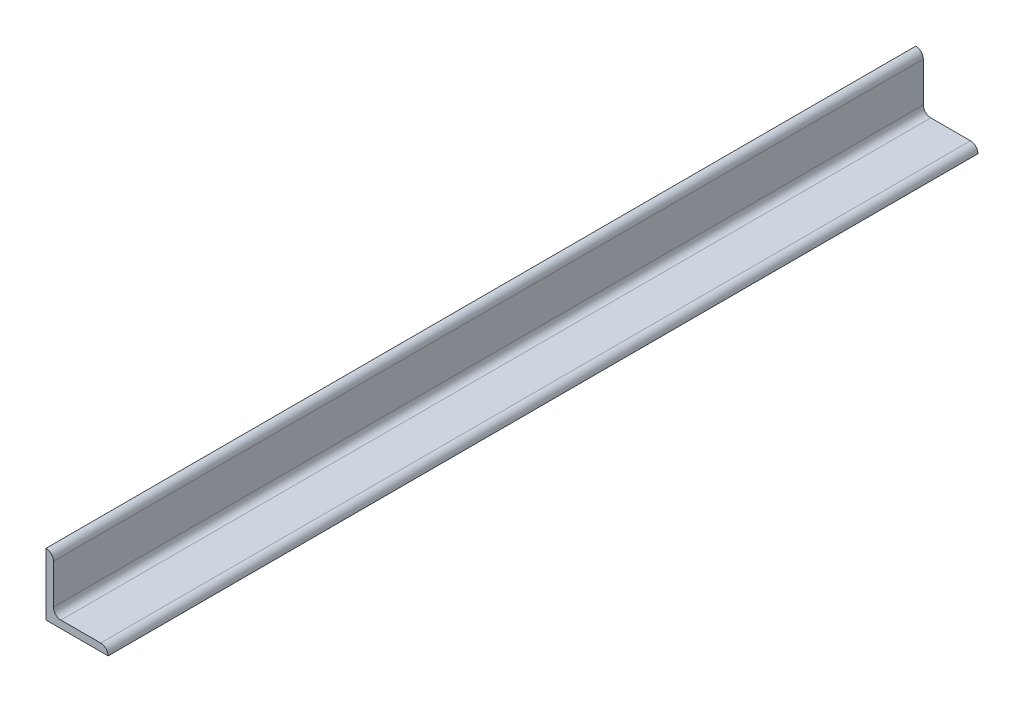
ISO-10303-21;
HEADER;
FILE_DESCRIPTION(('STEP AP214'),'2;1');
FILE_NAME('part.step','',(''),(''),'','','');
FILE_SCHEMA(('AUTOMOTIVE_DESIGN { 1 0 10303 214 1 1 1 1 }'));
ENDSEC;
DATA;
#1=APPLICATION_CONTEXT('core data for automotive mechanical design processes');
#2=APPLICATION_PROTOCOL_DEFINITION('international standard','automotive_design',2000,#1);
#3=PRODUCT_CONTEXT('',#1,'mechanical');
#4=PRODUCT('Part','Part','',(#3));
#5=PRODUCT_RELATED_PRODUCT_CATEGORY('part','',(#4));
#6=PRODUCT_DEFINITION_FORMATION('','',#4);
#7=PRODUCT_DEFINITION_CONTEXT('part definition',#1,'design');
#8=PRODUCT_DEFINITION('design','',#6,#7);
#9=PRODUCT_DEFINITION_SHAPE('','',#8);
#10=(LENGTH_UNIT() NAMED_UNIT(*) SI_UNIT(.MILLI.,.METRE.));
#11=(NAMED_UNIT(*) PLANE_ANGLE_UNIT() SI_UNIT($,.RADIAN.));
#12=(NAMED_UNIT(*) SI_UNIT($,.STERADIAN.) SOLID_ANGLE_UNIT());
#13=UNCERTAINTY_MEASURE_WITH_UNIT(LENGTH_MEASURE(1.E-05),#10,'distance_accuracy_value','');
#14=(GEOMETRIC_REPRESENTATION_CONTEXT(3) GLOBAL_UNCERTAINTY_ASSIGNED_CONTEXT((#13)) GLOBAL_UNIT_ASSIGNED_CONTEXT((#10,
#11,#12)) REPRESENTATION_CONTEXT('',''));
#15=CARTESIAN_POINT('',(0.,0.,0.));
#16=DIRECTION('',(0.,0.,1.));
#17=DIRECTION('',(1.,0.,0.));
#18=AXIS2_PLACEMENT_3D('',#15,#16,#17);
#19=CARTESIAN_POINT('',(50.,0.,-350.));
#20=DIRECTION('',(0.,-1.,0.));
#21=DIRECTION('',(1.,0.,0.));
#22=AXIS2_PLACEMENT_3D('',#19,#20,#21);
#23=PLANE('',#22);
#24=DIRECTION('',(1.,0.,0.));
#25=VECTOR('',#24,1.);
#26=CARTESIAN_POINT('',(50.,0.,350.));
#27=LINE('',#26,#25);
#28=CARTESIAN_POINT('',(0.,0.,350.));
#29=VERTEX_POINT('',#28);
#30=CARTESIAN_POINT('',(50.,0.,350.));
#31=VERTEX_POINT('',#30);
#32=EDGE_CURVE('E130',#29,#31,#27,.T.);
#33=ORIENTED_EDGE('',*,*,#32,.F.);
#34=DIRECTION('',(0.,0.,1.));
#35=VECTOR('',#34,1.);
#36=CARTESIAN_POINT('',(0.,0.,-350.));
#37=LINE('',#36,#35);
#38=CARTESIAN_POINT('',(0.,0.,-350.));
#39=VERTEX_POINT('',#38);
#40=EDGE_CURVE('E106',#39,#29,#37,.T.);
#41=ORIENTED_EDGE('',*,*,#40,.F.);
#42=DIRECTION('',(1.,0.,0.));
#43=VECTOR('',#42,1.);
#44=CARTESIAN_POINT('',(50.,0.,-350.));
#45=LINE('',#44,#43);
#46=CARTESIAN_POINT('',(50.,0.,-350.));
#47=VERTEX_POINT('',#46);
#48=EDGE_CURVE('E95',#39,#47,#45,.T.);
#49=ORIENTED_EDGE('',*,*,#48,.T.);
#50=DIRECTION('',(0.,0.,1.));
#51=VECTOR('',#50,1.);
#52=CARTESIAN_POINT('',(50.,0.,-350.));
#53=LINE('',#52,#51);
#54=EDGE_CURVE('E104',#47,#31,#53,.T.);
#55=ORIENTED_EDGE('',*,*,#54,.T.);
#56=EDGE_LOOP('',(#33,#41,#49,#55));
#57=FACE_BOUND('',#56,.T.);
#58=ADVANCED_FACE('F32',(#57),#23,.T.);
#59=CARTESIAN_POINT('',(0.,50.,-350.));
#60=DIRECTION('',(-1.,0.,0.));
#61=DIRECTION('',(0.,-1.,0.));
#62=AXIS2_PLACEMENT_3D('',#59,#60,#61);
#63=PLANE('',#62);
#64=DIRECTION('',(0.,-1.,0.));
#65=VECTOR('',#64,1.);
#66=CARTESIAN_POINT('',(0.,50.,350.));
#67=LINE('',#66,#65);
#68=CARTESIAN_POINT('',(0.,50.,350.));
#69=VERTEX_POINT('',#68);
#70=EDGE_CURVE('E107',#69,#29,#67,.T.);
#71=ORIENTED_EDGE('',*,*,#70,.F.);
#72=DIRECTION('',(0.,0.,1.));
#73=VECTOR('',#72,1.);
#74=CARTESIAN_POINT('',(0.,50.,-350.));
#75=LINE('',#74,#73);
#76=CARTESIAN_POINT('',(0.,50.,-350.));
#77=VERTEX_POINT('',#76);
#78=EDGE_CURVE('E144',#77,#69,#75,.T.);
#79=ORIENTED_EDGE('',*,*,#78,.F.);
#80=DIRECTION('',(0.,-1.,0.));
#81=VECTOR('',#80,1.);
#82=CARTESIAN_POINT('',(0.,50.,-350.));
#83=LINE('',#82,#81);
#84=EDGE_CURVE('E112',#77,#39,#83,.T.);
#85=ORIENTED_EDGE('',*,*,#84,.T.);
#86=ORIENTED_EDGE('',*,*,#40,.T.);
#87=EDGE_LOOP('',(#71,#79,#85,#86));
#88=FACE_BOUND('',#87,.T.);
#89=ADVANCED_FACE('F157',(#88),#63,.T.);
#90=CARTESIAN_POINT('',(6.,50.,-350.));
#91=DIRECTION('',(1.,0.,0.));
#92=DIRECTION('',(0.,1.,0.));
#93=AXIS2_PLACEMENT_3D('',#90,#91,#92);
#94=PLANE('',#93);
#95=DIRECTION('',(0.,1.,0.));
#96=VECTOR('',#95,1.);
#97=CARTESIAN_POINT('',(6.,50.,-350.));
#98=LINE('',#97,#96);
#99=CARTESIAN_POINT('',(6.,12.,-350.));
#100=VERTEX_POINT('',#99);
#101=CARTESIAN_POINT('',(6.,44.,-350.));
#102=VERTEX_POINT('',#101);
#103=EDGE_CURVE('E117',#100,#102,#98,.T.);
#104=ORIENTED_EDGE('',*,*,#103,.T.);
#105=DIRECTION('',(0.,0.,1.));
#106=VECTOR('',#105,1.);
#107=CARTESIAN_POINT('',(6.,44.,-350.));
#108=LINE('',#107,#106);
#109=CARTESIAN_POINT('',(6.,44.,350.));
#110=VERTEX_POINT('',#109);
#111=EDGE_CURVE('E11',#102,#110,#108,.T.);
#112=ORIENTED_EDGE('',*,*,#111,.T.);
#113=DIRECTION('',(0.,1.,0.));
#114=VECTOR('',#113,1.);
#115=CARTESIAN_POINT('',(6.,50.,350.));
#116=LINE('',#115,#114);
#117=CARTESIAN_POINT('',(6.,12.,350.));
#118=VERTEX_POINT('',#117);
#119=EDGE_CURVE('E136',#118,#110,#116,.T.);
#120=ORIENTED_EDGE('',*,*,#119,.F.);
#121=DIRECTION('',(0.,0.,1.));
#122=VECTOR('',#121,1.);
#123=CARTESIAN_POINT('',(6.,12.,-350.));
#124=LINE('',#123,#122);
#125=EDGE_CURVE('E115',#100,#118,#124,.T.);
#126=ORIENTED_EDGE('',*,*,#125,.F.);
#127=EDGE_LOOP('',(#104,#112,#120,#126));
#128=FACE_BOUND('',#127,.T.);
#129=ADVANCED_FACE('F152',(#128),#94,.T.);
#130=CARTESIAN_POINT('',(12.,12.,-350.));
#131=DIRECTION('',(0.,0.,1.));
#132=DIRECTION('',(1.,0.,0.));
#133=AXIS2_PLACEMENT_3D('',#130,#131,#132);
#134=CYLINDRICAL_SURFACE('',#133,6.);
#135=CARTESIAN_POINT('',(12.,12.,350.));
#136=DIRECTION('',(0.,0.,-1.));
#137=DIRECTION('',(-1.,0.,0.));
#138=AXIS2_PLACEMENT_3D('',#135,#136,#137);
#139=CIRCLE('',#138,6.);
#140=CARTESIAN_POINT('',(12.,6.,350.));
#141=VERTEX_POINT('',#140);
#142=EDGE_CURVE('E134',#141,#118,#139,.T.);
#143=ORIENTED_EDGE('',*,*,#142,.F.);
#144=DIRECTION('',(0.,0.,1.));
#145=VECTOR('',#144,1.);
#146=CARTESIAN_POINT('',(12.,6.,-350.));
#147=LINE('',#146,#145);
#148=CARTESIAN_POINT('',(12.,6.,-350.));
#149=VERTEX_POINT('',#148);
#150=EDGE_CURVE('E111',#149,#141,#147,.T.);
#151=ORIENTED_EDGE('',*,*,#150,.F.);
#152=CARTESIAN_POINT('',(12.,12.,-350.));
#153=DIRECTION('',(0.,0.,-1.));
#154=DIRECTION('',(-1.,0.,0.));
#155=AXIS2_PLACEMENT_3D('',#152,#153,#154);
#156=CIRCLE('',#155,6.);
#157=EDGE_CURVE('E150',#149,#100,#156,.T.);
#158=ORIENTED_EDGE('',*,*,#157,.T.);
#159=ORIENTED_EDGE('',*,*,#125,.T.);
#160=EDGE_LOOP('',(#143,#151,#158,#159));
#161=FACE_BOUND('',#160,.T.);
#162=ADVANCED_FACE('F149',(#161),#134,.F.);
#163=CARTESIAN_POINT('',(12.,6.,-350.));
#164=DIRECTION('',(0.,1.,0.));
#165=DIRECTION('',(0.,0.,1.));
#166=AXIS2_PLACEMENT_3D('',#163,#164,#165);
#167=PLANE('',#166);
#168=DIRECTION('',(-1.,0.,0.));
#169=VECTOR('',#168,1.);
#170=CARTESIAN_POINT('',(12.,6.,350.));
#171=LINE('',#170,#169);
#172=CARTESIAN_POINT('',(44.,6.,350.));
#173=VERTEX_POINT('',#172);
#174=EDGE_CURVE('E128',#173,#141,#171,.T.);
#175=ORIENTED_EDGE('',*,*,#174,.F.);
#176=DIRECTION('',(0.,0.,1.));
#177=VECTOR('',#176,1.);
#178=CARTESIAN_POINT('',(44.,6.,-350.));
#179=LINE('',#178,#177);
#180=CARTESIAN_POINT('',(44.,6.,-350.));
#181=VERTEX_POINT('',#180);
#182=EDGE_CURVE('E55',#173,#181,#179,.F.);
#183=ORIENTED_EDGE('',*,*,#182,.T.);
#184=DIRECTION('',(-1.,0.,0.));
#185=VECTOR('',#184,1.);
#186=CARTESIAN_POINT('',(12.,6.,-350.));
#187=LINE('',#186,#185);
#188=EDGE_CURVE('E98',#181,#149,#187,.T.);
#189=ORIENTED_EDGE('',*,*,#188,.T.);
#190=ORIENTED_EDGE('',*,*,#150,.T.);
#191=EDGE_LOOP('',(#175,#183,#189,#190));
#192=FACE_BOUND('',#191,.T.);
#193=ADVANCED_FACE('F131',(#192),#167,.T.);
#194=CARTESIAN_POINT('',(12.,12.,-350.));
#195=DIRECTION('',(0.,0.,-1.));
#196=DIRECTION('',(-1.,0.,0.));
#197=AXIS2_PLACEMENT_3D('',#194,#195,#196);
#198=PLANE('',#197);
#199=ORIENTED_EDGE('',*,*,#188,.F.);
#200=CARTESIAN_POINT('',(44.,0.,-350.));
#201=DIRECTION('',(0.,0.,-1.));
#202=DIRECTION('',(-1.,0.,0.));
#203=AXIS2_PLACEMENT_3D('',#200,#201,#202);
#204=CIRCLE('',#203,6.);
#205=EDGE_CURVE('E40',#181,#47,#204,.T.);
#206=ORIENTED_EDGE('',*,*,#205,.T.);
#207=ORIENTED_EDGE('',*,*,#48,.F.);
#208=ORIENTED_EDGE('',*,*,#84,.F.);
#209=CARTESIAN_POINT('',(0.,44.,-350.));
#210=DIRECTION('',(0.,0.,-1.));
#211=DIRECTION('',(-1.,0.,0.));
#212=AXIS2_PLACEMENT_3D('',#209,#210,#211);
#213=CIRCLE('',#212,6.);
#214=EDGE_CURVE('E47',#77,#102,#213,.T.);
#215=ORIENTED_EDGE('',*,*,#214,.T.);
#216=ORIENTED_EDGE('',*,*,#103,.F.);
#217=ORIENTED_EDGE('',*,*,#157,.F.);
#218=EDGE_LOOP('',(#199,#206,#207,#208,#215,#216,#217));
#219=FACE_BOUND('',#218,.T.);
#220=ADVANCED_FACE('F94',(#219),#198,.T.);
#221=CARTESIAN_POINT('',(12.,12.,350.));
#222=DIRECTION('',(0.,0.,-1.));
#223=DIRECTION('',(-1.,0.,0.));
#224=AXIS2_PLACEMENT_3D('',#221,#222,#223);
#225=PLANE('',#224);
#226=ORIENTED_EDGE('',*,*,#32,.T.);
#227=CARTESIAN_POINT('',(44.,0.,350.));
#228=DIRECTION('',(0.,0.,-1.));
#229=DIRECTION('',(-1.,0.,0.));
#230=AXIS2_PLACEMENT_3D('',#227,#228,#229);
#231=CIRCLE('',#230,6.);
#232=EDGE_CURVE('E110',#31,#173,#231,.F.);
#233=ORIENTED_EDGE('',*,*,#232,.T.);
#234=ORIENTED_EDGE('',*,*,#174,.T.);
#235=ORIENTED_EDGE('',*,*,#142,.T.);
#236=ORIENTED_EDGE('',*,*,#119,.T.);
#237=CARTESIAN_POINT('',(0.,44.,350.));
#238=DIRECTION('',(0.,0.,-1.));
#239=DIRECTION('',(-1.,0.,0.));
#240=AXIS2_PLACEMENT_3D('',#237,#238,#239);
#241=CIRCLE('',#240,6.);
#242=EDGE_CURVE('E121',#110,#69,#241,.F.);
#243=ORIENTED_EDGE('',*,*,#242,.T.);
#244=ORIENTED_EDGE('',*,*,#70,.T.);
#245=EDGE_LOOP('',(#226,#233,#234,#235,#236,#243,#244));
#246=FACE_BOUND('',#245,.T.);
#247=ADVANCED_FACE('F126',(#246),#225,.F.);
#248=CARTESIAN_POINT('',(44.,0.,-350.));
#249=DIRECTION('',(0.,0.,1.));
#250=DIRECTION('',(1.,0.,0.));
#251=AXIS2_PLACEMENT_3D('',#248,#249,#250);
#252=CYLINDRICAL_SURFACE('',#251,6.);
#253=ORIENTED_EDGE('',*,*,#205,.F.);
#254=ORIENTED_EDGE('',*,*,#182,.F.);
#255=ORIENTED_EDGE('',*,*,#232,.F.);
#256=ORIENTED_EDGE('',*,*,#54,.F.);
#257=EDGE_LOOP('',(#253,#254,#255,#256));
#258=FACE_BOUND('',#257,.T.);
#259=ADVANCED_FACE('F109',(#258),#252,.T.);
#260=CARTESIAN_POINT('',(0.,44.,-350.));
#261=DIRECTION('',(0.,0.,1.));
#262=DIRECTION('',(1.,0.,0.));
#263=AXIS2_PLACEMENT_3D('',#260,#261,#262);
#264=CYLINDRICAL_SURFACE('',#263,6.);
#265=ORIENTED_EDGE('',*,*,#214,.F.);
#266=ORIENTED_EDGE('',*,*,#78,.T.);
#267=ORIENTED_EDGE('',*,*,#242,.F.);
#268=ORIENTED_EDGE('',*,*,#111,.F.);
#269=EDGE_LOOP('',(#265,#266,#267,#268));
#270=FACE_BOUND('',#269,.T.);
#271=ADVANCED_FACE('F34',(#270),#264,.T.);
#272=CLOSED_SHELL('',(#58,#89,#129,#162,#193,#220,#247,#259,#271));
#273=MANIFOLD_SOLID_BREP('B2',#272);
#274=ADVANCED_BREP_SHAPE_REPRESENTATION('',(#18,#273),#14);
#275=SHAPE_DEFINITION_REPRESENTATION(#9,#274);
ENDSEC;
END-ISO-10303-21;
